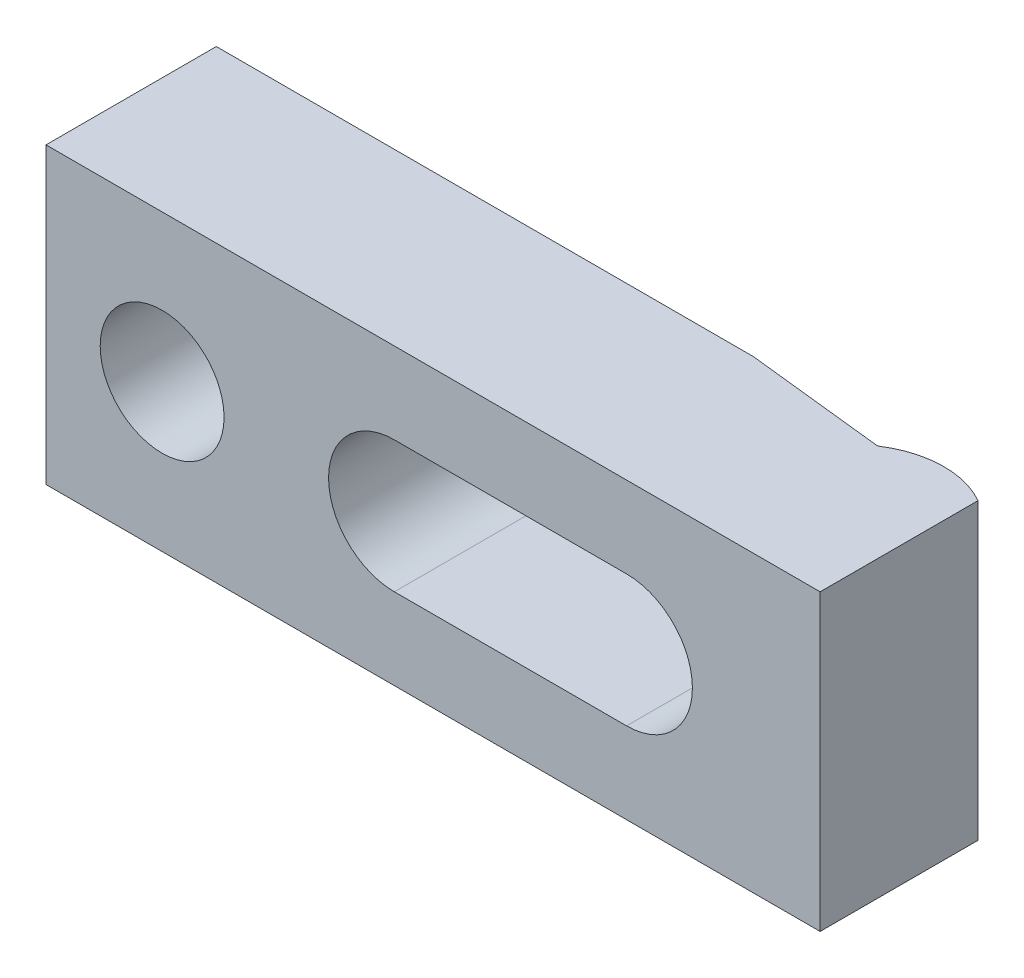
ISO-10303-21;
HEADER;
FILE_DESCRIPTION(('STEP AP214'),'2;1');
FILE_NAME('part.step','',(''),(''),'','','');
FILE_SCHEMA(('AUTOMOTIVE_DESIGN { 1 0 10303 214 1 1 1 1 }'));
ENDSEC;
DATA;
#1=APPLICATION_CONTEXT('core data for automotive mechanical design processes');
#2=APPLICATION_PROTOCOL_DEFINITION('international standard','automotive_design',2000,#1);
#3=PRODUCT_CONTEXT('',#1,'mechanical');
#4=PRODUCT('Part','Part','',(#3));
#5=PRODUCT_RELATED_PRODUCT_CATEGORY('part','',(#4));
#6=PRODUCT_DEFINITION_FORMATION('','',#4);
#7=PRODUCT_DEFINITION_CONTEXT('part definition',#1,'design');
#8=PRODUCT_DEFINITION('design','',#6,#7);
#9=PRODUCT_DEFINITION_SHAPE('','',#8);
#10=(LENGTH_UNIT() NAMED_UNIT(*) SI_UNIT(.MILLI.,.METRE.));
#11=(NAMED_UNIT(*) PLANE_ANGLE_UNIT() SI_UNIT($,.RADIAN.));
#12=(NAMED_UNIT(*) SI_UNIT($,.STERADIAN.) SOLID_ANGLE_UNIT());
#13=UNCERTAINTY_MEASURE_WITH_UNIT(LENGTH_MEASURE(1.E-05),#10,'distance_accuracy_value','');
#14=(GEOMETRIC_REPRESENTATION_CONTEXT(3) GLOBAL_UNCERTAINTY_ASSIGNED_CONTEXT((#13)) GLOBAL_UNIT_ASSIGNED_CONTEXT((#10,
#11,#12)) REPRESENTATION_CONTEXT('',''));
#15=CARTESIAN_POINT('',(0.,0.,0.));
#16=DIRECTION('',(0.,0.,1.));
#17=DIRECTION('',(1.,0.,0.));
#18=AXIS2_PLACEMENT_3D('',#15,#16,#17);
#19=CARTESIAN_POINT('',(-75.,19.,0.));
#20=DIRECTION('',(0.,0.,-1.));
#21=DIRECTION('',(-1.,0.,0.));
#22=AXIS2_PLACEMENT_3D('',#19,#20,#21);
#23=PLANE('',#22);
#24=DIRECTION('',(1.,0.,0.));
#25=VECTOR('',#24,1.);
#26=CARTESIAN_POINT('',(-30.,8.5,0.));
#27=LINE('',#26,#25);
#28=CARTESIAN_POINT('',(-75.,8.5,0.));
#29=VERTEX_POINT('',#28);
#30=CARTESIAN_POINT('',(-5.6,8.5,0.));
#31=VERTEX_POINT('',#30);
#32=EDGE_CURVE('E122',#29,#31,#27,.T.);
#33=ORIENTED_EDGE('',*,*,#32,.F.);
#34=DIRECTION('',(0.,-1.,0.));
#35=VECTOR('',#34,1.);
#36=CARTESIAN_POINT('',(-75.,19.,0.));
#37=LINE('',#36,#35);
#38=CARTESIAN_POINT('',(-75.,19.,0.));
#39=VERTEX_POINT('',#38);
#40=EDGE_CURVE('E139',#39,#29,#37,.T.);
#41=ORIENTED_EDGE('',*,*,#40,.F.);
#42=DIRECTION('',(1.,0.,0.));
#43=VECTOR('',#42,1.);
#44=CARTESIAN_POINT('',(-75.,19.,0.));
#45=LINE('',#44,#43);
#46=CARTESIAN_POINT('',(-5.6,19.,0.));
#47=VERTEX_POINT('',#46);
#48=EDGE_CURVE('E196',#39,#47,#45,.T.);
#49=ORIENTED_EDGE('',*,*,#48,.T.);
#50=DIRECTION('',(0.,-1.,0.));
#51=VECTOR('',#50,1.);
#52=CARTESIAN_POINT('',(-5.6,19.,0.));
#53=LINE('',#52,#51);
#54=EDGE_CURVE('E147',#47,#31,#53,.T.);
#55=ORIENTED_EDGE('',*,*,#54,.T.);
#56=EDGE_LOOP('',(#33,#41,#49,#55));
#57=FACE_BOUND('',#56,.T.);
#58=ADVANCED_FACE('F14',(#57),#23,.T.);
#59=CARTESIAN_POINT('',(-75.,19.,22.));
#60=DIRECTION('',(-1.,0.,0.));
#61=DIRECTION('',(0.,0.,1.));
#62=AXIS2_PLACEMENT_3D('',#59,#60,#61);
#63=PLANE('',#62);
#64=ORIENTED_EDGE('',*,*,#40,.T.);
#65=DIRECTION('',(0.,0.,1.));
#66=VECTOR('',#65,1.);
#67=CARTESIAN_POINT('',(-75.,8.5,22.));
#68=LINE('',#67,#66);
#69=CARTESIAN_POINT('',(-75.,8.5,5.));
#70=VERTEX_POINT('',#69);
#71=EDGE_CURVE('E133',#29,#70,#68,.T.);
#72=ORIENTED_EDGE('',*,*,#71,.T.);
#73=DIRECTION('',(0.,-1.,0.));
#74=VECTOR('',#73,1.);
#75=CARTESIAN_POINT('',(-75.,19.,5.));
#76=LINE('',#75,#74);
#77=CARTESIAN_POINT('',(-75.,-8.5,5.));
#78=VERTEX_POINT('',#77);
#79=EDGE_CURVE('E132',#70,#78,#76,.T.);
#80=ORIENTED_EDGE('',*,*,#79,.T.);
#81=DIRECTION('',(0.,0.,1.));
#82=VECTOR('',#81,1.);
#83=CARTESIAN_POINT('',(-75.,-8.5,22.));
#84=LINE('',#83,#82);
#85=CARTESIAN_POINT('',(-75.,-8.5,0.));
#86=VERTEX_POINT('',#85);
#87=EDGE_CURVE('E113',#86,#78,#84,.T.);
#88=ORIENTED_EDGE('',*,*,#87,.F.);
#89=CARTESIAN_POINT('',(-75.,-19.,0.));
#90=VERTEX_POINT('',#89);
#91=EDGE_CURVE('E129',#86,#90,#37,.T.);
#92=ORIENTED_EDGE('',*,*,#91,.T.);
#93=DIRECTION('',(0.,0.,-1.));
#94=VECTOR('',#93,1.);
#95=CARTESIAN_POINT('',(-75.,-19.,22.));
#96=LINE('',#95,#94);
#97=CARTESIAN_POINT('',(-75.,-19.,22.));
#98=VERTEX_POINT('',#97);
#99=EDGE_CURVE('E169',#98,#90,#96,.T.);
#100=ORIENTED_EDGE('',*,*,#99,.F.);
#101=DIRECTION('',(0.,-1.,0.));
#102=VECTOR('',#101,1.);
#103=CARTESIAN_POINT('',(-75.,19.,22.));
#104=LINE('',#103,#102);
#105=CARTESIAN_POINT('',(-75.,19.,22.));
#106=VERTEX_POINT('',#105);
#107=EDGE_CURVE('E140',#106,#98,#104,.T.);
#108=ORIENTED_EDGE('',*,*,#107,.F.);
#109=DIRECTION('',(0.,0.,-1.));
#110=VECTOR('',#109,1.);
#111=CARTESIAN_POINT('',(-75.,19.,22.));
#112=LINE('',#111,#110);
#113=EDGE_CURVE('E179',#106,#39,#112,.T.);
#114=ORIENTED_EDGE('',*,*,#113,.T.);
#115=EDGE_LOOP('',(#64,#72,#80,#88,#92,#100,#108,#114));
#116=FACE_BOUND('',#115,.T.);
#117=ADVANCED_FACE('F127',(#116),#63,.T.);
#118=CARTESIAN_POINT('',(-30.,0.,22.));
#119=DIRECTION('',(0.,0.,-1.));
#120=DIRECTION('',(-1.,0.,0.));
#121=AXIS2_PLACEMENT_3D('',#118,#119,#120);
#122=CYLINDRICAL_SURFACE('',#121,8.5);
#123=DIRECTION('',(0.,0.,-1.));
#124=VECTOR('',#123,1.);
#125=CARTESIAN_POINT('',(-30.,-8.5,22.));
#126=LINE('',#125,#124);
#127=CARTESIAN_POINT('',(-30.,-8.5,22.));
#128=VERTEX_POINT('',#127);
#129=CARTESIAN_POINT('',(-30.,-8.5,5.));
#130=VERTEX_POINT('',#129);
#131=EDGE_CURVE('E229',#128,#130,#126,.T.);
#132=ORIENTED_EDGE('',*,*,#131,.T.);
#133=CARTESIAN_POINT('',(-30.,0.,5.));
#134=DIRECTION('',(0.,0.,-1.));
#135=DIRECTION('',(-1.,0.,0.));
#136=AXIS2_PLACEMENT_3D('',#133,#134,#135);
#137=CIRCLE('',#136,8.5);
#138=CARTESIAN_POINT('',(-30.,8.5,5.));
#139=VERTEX_POINT('',#138);
#140=EDGE_CURVE('E245',#130,#139,#137,.T.);
#141=ORIENTED_EDGE('',*,*,#140,.T.);
#142=DIRECTION('',(0.,0.,-1.));
#143=VECTOR('',#142,1.);
#144=CARTESIAN_POINT('',(-30.,8.5,22.));
#145=LINE('',#144,#143);
#146=CARTESIAN_POINT('',(-30.,8.5,22.));
#147=VERTEX_POINT('',#146);
#148=EDGE_CURVE('E231',#147,#139,#145,.T.);
#149=ORIENTED_EDGE('',*,*,#148,.F.);
#150=CARTESIAN_POINT('',(-30.,0.,22.));
#151=DIRECTION('',(0.,0.,1.));
#152=DIRECTION('',(1.,0.,0.));
#153=AXIS2_PLACEMENT_3D('',#150,#151,#152);
#154=CIRCLE('',#153,8.5);
#155=EDGE_CURVE('E38',#147,#128,#154,.T.);
#156=ORIENTED_EDGE('',*,*,#155,.T.);
#157=EDGE_LOOP('',(#132,#141,#149,#156));
#158=FACE_BOUND('',#157,.T.);
#159=ADVANCED_FACE('F244',(#158),#122,.F.);
#160=CARTESIAN_POINT('',(-60.,0.,22.));
#161=DIRECTION('',(0.,0.,-1.));
#162=DIRECTION('',(-1.,0.,0.));
#163=AXIS2_PLACEMENT_3D('',#160,#161,#162);
#164=CYLINDRICAL_SURFACE('',#163,8.);
#165=CARTESIAN_POINT('',(-60.,0.,22.));
#166=DIRECTION('',(0.,0.,1.));
#167=DIRECTION('',(1.,0.,0.));
#168=AXIS2_PLACEMENT_3D('',#165,#166,#167);
#169=CIRCLE('',#168,8.);
#170=CARTESIAN_POINT('',(-52.,0.,22.));
#171=VERTEX_POINT('',#170);
#172=EDGE_CURVE('E209',#171,#171,#169,.T.);
#173=ORIENTED_EDGE('',*,*,#172,.T.);
#174=EDGE_LOOP('',(#173));
#175=FACE_BOUND('',#174,.T.);
#176=CARTESIAN_POINT('',(-60.,0.,5.));
#177=DIRECTION('',(0.,0.,-1.));
#178=DIRECTION('',(-1.,0.,0.));
#179=AXIS2_PLACEMENT_3D('',#176,#177,#178);
#180=CIRCLE('',#179,8.);
#181=CARTESIAN_POINT('',(-68.,0.,5.));
#182=VERTEX_POINT('',#181);
#183=EDGE_CURVE('E18',#182,#182,#180,.T.);
#184=ORIENTED_EDGE('',*,*,#183,.T.);
#185=EDGE_LOOP('',(#184));
#186=FACE_BOUND('',#185,.T.);
#187=ADVANCED_FACE('F275',(#175,#186),#164,.F.);
#188=CARTESIAN_POINT('',(25.,19.,22.));
#189=DIRECTION('',(0.,0.,1.));
#190=DIRECTION('',(1.,0.,0.));
#191=AXIS2_PLACEMENT_3D('',#188,#189,#190);
#192=PLANE('',#191);
#193=DIRECTION('',(1.,0.,0.));
#194=VECTOR('',#193,1.);
#195=CARTESIAN_POINT('',(-30.,8.5,22.));
#196=LINE('',#195,#194);
#197=CARTESIAN_POINT('',(0.,8.5,22.));
#198=VERTEX_POINT('',#197);
#199=EDGE_CURVE('E223',#147,#198,#196,.T.);
#200=ORIENTED_EDGE('',*,*,#199,.T.);
#201=CARTESIAN_POINT('',(0.,0.,22.));
#202=DIRECTION('',(0.,0.,1.));
#203=DIRECTION('',(1.,0.,0.));
#204=AXIS2_PLACEMENT_3D('',#201,#202,#203);
#205=CIRCLE('',#204,8.5);
#206=CARTESIAN_POINT('',(0.,-8.5,22.));
#207=VERTEX_POINT('',#206);
#208=EDGE_CURVE('E121',#207,#198,#205,.T.);
#209=ORIENTED_EDGE('',*,*,#208,.F.);
#210=DIRECTION('',(-1.,0.,0.));
#211=VECTOR('',#210,1.);
#212=CARTESIAN_POINT('',(0.,-8.5,22.));
#213=LINE('',#212,#211);
#214=EDGE_CURVE('E218',#207,#128,#213,.T.);
#215=ORIENTED_EDGE('',*,*,#214,.T.);
#216=ORIENTED_EDGE('',*,*,#155,.F.);
#217=EDGE_LOOP('',(#200,#209,#215,#216));
#218=FACE_BOUND('',#217,.T.);
#219=DIRECTION('',(0.,-1.,0.));
#220=VECTOR('',#219,1.);
#221=CARTESIAN_POINT('',(25.,19.,22.));
#222=LINE('',#221,#220);
#223=CARTESIAN_POINT('',(25.,19.,22.));
#224=VERTEX_POINT('',#223);
#225=CARTESIAN_POINT('',(25.,-19.,22.));
#226=VERTEX_POINT('',#225);
#227=EDGE_CURVE('E23',#224,#226,#222,.T.);
#228=ORIENTED_EDGE('',*,*,#227,.F.);
#229=DIRECTION('',(-1.,0.,0.));
#230=VECTOR('',#229,1.);
#231=CARTESIAN_POINT('',(25.,19.,22.));
#232=LINE('',#231,#230);
#233=EDGE_CURVE('E177',#224,#106,#232,.T.);
#234=ORIENTED_EDGE('',*,*,#233,.T.);
#235=ORIENTED_EDGE('',*,*,#107,.T.);
#236=DIRECTION('',(-1.,0.,0.));
#237=VECTOR('',#236,1.);
#238=CARTESIAN_POINT('',(25.,-19.,22.));
#239=LINE('',#238,#237);
#240=EDGE_CURVE('E165',#226,#98,#239,.T.);
#241=ORIENTED_EDGE('',*,*,#240,.F.);
#242=EDGE_LOOP('',(#228,#234,#235,#241));
#243=FACE_BOUND('',#242,.T.);
#244=ORIENTED_EDGE('',*,*,#172,.F.);
#245=EDGE_LOOP('',(#244));
#246=FACE_BOUND('',#245,.T.);
#247=ADVANCED_FACE('F166',(#218,#243,#246),#192,.T.);
#248=ORIENTED_EDGE('',*,*,#91,.F.);
#249=DIRECTION('',(-1.,0.,0.));
#250=VECTOR('',#249,1.);
#251=CARTESIAN_POINT('',(0.,-8.5,0.));
#252=LINE('',#251,#250);
#253=CARTESIAN_POINT('',(-5.6,-8.5,0.));
#254=VERTEX_POINT('',#253);
#255=EDGE_CURVE('E109',#254,#86,#252,.T.);
#256=ORIENTED_EDGE('',*,*,#255,.F.);
#257=CARTESIAN_POINT('',(-5.6,-19.,0.));
#258=VERTEX_POINT('',#257);
#259=EDGE_CURVE('E142',#254,#258,#53,.T.);
#260=ORIENTED_EDGE('',*,*,#259,.T.);
#261=DIRECTION('',(1.,0.,0.));
#262=VECTOR('',#261,1.);
#263=CARTESIAN_POINT('',(-75.,-19.,0.));
#264=LINE('',#263,#262);
#265=EDGE_CURVE('E138',#90,#258,#264,.T.);
#266=ORIENTED_EDGE('',*,*,#265,.F.);
#267=EDGE_LOOP('',(#248,#256,#260,#266));
#268=FACE_BOUND('',#267,.T.);
#269=ADVANCED_FACE('F136',(#268),#23,.T.);
#270=CARTESIAN_POINT('',(25.,19.,22.));
#271=DIRECTION('',(-1.,0.,0.));
#272=DIRECTION('',(0.,0.,1.));
#273=AXIS2_PLACEMENT_3D('',#270,#271,#272);
#274=PLANE('',#273);
#275=DIRECTION('',(0.,-1.,0.));
#276=VECTOR('',#275,1.);
#277=CARTESIAN_POINT('',(25.,19.,1.60769515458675));
#278=LINE('',#277,#276);
#279=CARTESIAN_POINT('',(25.,19.,1.60769515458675));
#280=VERTEX_POINT('',#279);
#281=CARTESIAN_POINT('',(25.,-19.,1.60769515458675));
#282=VERTEX_POINT('',#281);
#283=EDGE_CURVE('E152',#280,#282,#278,.T.);
#284=ORIENTED_EDGE('',*,*,#283,.F.);
#285=DIRECTION('',(0.,0.,-1.));
#286=VECTOR('',#285,1.);
#287=CARTESIAN_POINT('',(25.,19.,22.));
#288=LINE('',#287,#286);
#289=EDGE_CURVE('E143',#224,#280,#288,.T.);
#290=ORIENTED_EDGE('',*,*,#289,.F.);
#291=ORIENTED_EDGE('',*,*,#227,.T.);
#292=DIRECTION('',(0.,0.,-1.));
#293=VECTOR('',#292,1.);
#294=CARTESIAN_POINT('',(25.,-19.,22.));
#295=LINE('',#294,#293);
#296=EDGE_CURVE('E159',#226,#282,#295,.T.);
#297=ORIENTED_EDGE('',*,*,#296,.T.);
#298=EDGE_LOOP('',(#284,#290,#291,#297));
#299=FACE_BOUND('',#298,.T.);
#300=ADVANCED_FACE('F16',(#299),#274,.F.);
#301=CARTESIAN_POINT('',(19.,19.,12.));
#302=DIRECTION('',(0.,-1.,0.));
#303=DIRECTION('',(0.,0.,-1.));
#304=AXIS2_PLACEMENT_3D('',#301,#302,#303);
#305=CYLINDRICAL_SURFACE('',#304,12.);
#306=DIRECTION('',(0.,-1.,0.));
#307=VECTOR('',#306,1.);
#308=CARTESIAN_POINT('',(12.4,19.,1.97802414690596));
#309=LINE('',#308,#307);
#310=CARTESIAN_POINT('',(12.4,19.,1.97802414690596));
#311=VERTEX_POINT('',#310);
#312=CARTESIAN_POINT('',(12.4,-19.,1.97802414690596));
#313=VERTEX_POINT('',#312);
#314=EDGE_CURVE('E150',#311,#313,#309,.T.);
#315=ORIENTED_EDGE('',*,*,#314,.F.);
#316=CARTESIAN_POINT('',(19.,19.,12.));
#317=DIRECTION('',(0.,1.,0.));
#318=DIRECTION('',(0.,0.,1.));
#319=AXIS2_PLACEMENT_3D('',#316,#317,#318);
#320=CIRCLE('',#319,12.);
#321=EDGE_CURVE('E190',#280,#311,#320,.T.);
#322=ORIENTED_EDGE('',*,*,#321,.F.);
#323=ORIENTED_EDGE('',*,*,#283,.T.);
#324=CARTESIAN_POINT('',(19.,-19.,12.));
#325=DIRECTION('',(0.,1.,0.));
#326=DIRECTION('',(0.,0.,1.));
#327=AXIS2_PLACEMENT_3D('',#324,#325,#326);
#328=CIRCLE('',#327,12.);
#329=EDGE_CURVE('E176',#282,#313,#328,.T.);
#330=ORIENTED_EDGE('',*,*,#329,.T.);
#331=EDGE_LOOP('',(#315,#322,#323,#330));
#332=FACE_BOUND('',#331,.T.);
#333=ADVANCED_FACE('F274',(#332),#305,.T.);
#334=CARTESIAN_POINT('',(12.4,19.,1.97802414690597));
#335=DIRECTION('',(-0.109232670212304,0.,0.99401620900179));
#336=DIRECTION('',(0.99401620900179,0.,0.109232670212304));
#337=AXIS2_PLACEMENT_3D('',#334,#335,#336);
#338=PLANE('',#337);
#339=CARTESIAN_POINT('',(0.,0.,0.615385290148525));
#340=DIRECTION('',(-0.109232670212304,0.,0.99401620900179));
#341=DIRECTION('',(-0.99401620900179,0.,-0.109232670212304));
#342=AXIS2_PLACEMENT_3D('',#339,#340,#341);
#343=ELLIPSE('',#342,8.55116840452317,8.5);
#344=CARTESIAN_POINT('',(0.,8.5,0.615385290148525));
#345=VERTEX_POINT('',#344);
#346=CARTESIAN_POINT('',(0.,-8.5,0.615385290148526));
#347=VERTEX_POINT('',#346);
#348=EDGE_CURVE('E9',#345,#347,#343,.F.);
#349=ORIENTED_EDGE('',*,*,#348,.F.);
#350=DIRECTION('',(-0.99401620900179,0.,-0.109232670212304));
#351=VECTOR('',#350,1.);
#352=CARTESIAN_POINT('',(12.4,8.5,1.97802414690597));
#353=LINE('',#352,#351);
#354=EDGE_CURVE('E170',#345,#31,#353,.T.);
#355=ORIENTED_EDGE('',*,*,#354,.T.);
#356=ORIENTED_EDGE('',*,*,#54,.F.);
#357=DIRECTION('',(-0.99401620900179,0.,-0.109232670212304));
#358=VECTOR('',#357,1.);
#359=CARTESIAN_POINT('',(12.4,19.,1.97802414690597));
#360=LINE('',#359,#358);
#361=EDGE_CURVE('E193',#311,#47,#360,.T.);
#362=ORIENTED_EDGE('',*,*,#361,.F.);
#363=ORIENTED_EDGE('',*,*,#314,.T.);
#364=DIRECTION('',(-0.99401620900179,0.,-0.109232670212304));
#365=VECTOR('',#364,1.);
#366=CARTESIAN_POINT('',(12.4,-19.,1.97802414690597));
#367=LINE('',#366,#365);
#368=EDGE_CURVE('E180',#313,#258,#367,.T.);
#369=ORIENTED_EDGE('',*,*,#368,.T.);
#370=ORIENTED_EDGE('',*,*,#259,.F.);
#371=DIRECTION('',(0.99401620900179,0.,0.109232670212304));
#372=VECTOR('',#371,1.);
#373=CARTESIAN_POINT('',(12.4,-8.5,1.97802414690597));
#374=LINE('',#373,#372);
#375=EDGE_CURVE('E117',#254,#347,#374,.T.);
#376=ORIENTED_EDGE('',*,*,#375,.T.);
#377=EDGE_LOOP('',(#349,#355,#356,#362,#363,#369,#370,#376));
#378=FACE_BOUND('',#377,.T.);
#379=ADVANCED_FACE('F237',(#378),#338,.F.);
#380=CARTESIAN_POINT('',(19.,19.,12.));
#381=DIRECTION('',(0.,1.,0.));
#382=DIRECTION('',(0.,0.,1.));
#383=AXIS2_PLACEMENT_3D('',#380,#381,#382);
#384=PLANE('',#383);
#385=ORIENTED_EDGE('',*,*,#233,.F.);
#386=ORIENTED_EDGE('',*,*,#289,.T.);
#387=ORIENTED_EDGE('',*,*,#321,.T.);
#388=ORIENTED_EDGE('',*,*,#361,.T.);
#389=ORIENTED_EDGE('',*,*,#48,.F.);
#390=ORIENTED_EDGE('',*,*,#113,.F.);
#391=EDGE_LOOP('',(#385,#386,#387,#388,#389,#390));
#392=FACE_BOUND('',#391,.T.);
#393=ADVANCED_FACE('F203',(#392),#384,.T.);
#394=CARTESIAN_POINT('',(19.,-19.,12.));
#395=DIRECTION('',(0.,1.,0.));
#396=DIRECTION('',(0.,0.,1.));
#397=AXIS2_PLACEMENT_3D('',#394,#395,#396);
#398=PLANE('',#397);
#399=ORIENTED_EDGE('',*,*,#240,.T.);
#400=ORIENTED_EDGE('',*,*,#99,.T.);
#401=ORIENTED_EDGE('',*,*,#265,.T.);
#402=ORIENTED_EDGE('',*,*,#368,.F.);
#403=ORIENTED_EDGE('',*,*,#329,.F.);
#404=ORIENTED_EDGE('',*,*,#296,.F.);
#405=EDGE_LOOP('',(#399,#400,#401,#402,#403,#404));
#406=FACE_BOUND('',#405,.T.);
#407=ADVANCED_FACE('F173',(#406),#398,.F.);
#408=CARTESIAN_POINT('',(0.,0.,22.));
#409=DIRECTION('',(0.,0.,-1.));
#410=DIRECTION('',(-1.,0.,0.));
#411=AXIS2_PLACEMENT_3D('',#408,#409,#410);
#412=CYLINDRICAL_SURFACE('',#411,8.5);
#413=ORIENTED_EDGE('',*,*,#348,.T.);
#414=DIRECTION('',(0.,0.,-1.));
#415=VECTOR('',#414,1.);
#416=CARTESIAN_POINT('',(0.,-8.5,22.));
#417=LINE('',#416,#415);
#418=EDGE_CURVE('E221',#207,#347,#417,.T.);
#419=ORIENTED_EDGE('',*,*,#418,.F.);
#420=ORIENTED_EDGE('',*,*,#208,.T.);
#421=DIRECTION('',(0.,0.,-1.));
#422=VECTOR('',#421,1.);
#423=CARTESIAN_POINT('',(0.,8.5,22.));
#424=LINE('',#423,#422);
#425=EDGE_CURVE('E233',#198,#345,#424,.T.);
#426=ORIENTED_EDGE('',*,*,#425,.T.);
#427=EDGE_LOOP('',(#413,#419,#420,#426));
#428=FACE_BOUND('',#427,.T.);
#429=ADVANCED_FACE('F240',(#428),#412,.F.);
#430=CARTESIAN_POINT('',(-30.,8.5,22.));
#431=DIRECTION('',(0.,1.,0.));
#432=DIRECTION('',(-1.,0.,0.));
#433=AXIS2_PLACEMENT_3D('',#430,#431,#432);
#434=PLANE('',#433);
#435=ORIENTED_EDGE('',*,*,#32,.T.);
#436=ORIENTED_EDGE('',*,*,#354,.F.);
#437=ORIENTED_EDGE('',*,*,#425,.F.);
#438=ORIENTED_EDGE('',*,*,#199,.F.);
#439=ORIENTED_EDGE('',*,*,#148,.T.);
#440=DIRECTION('',(-1.,0.,0.));
#441=VECTOR('',#440,1.);
#442=CARTESIAN_POINT('',(-15.,8.5,5.));
#443=LINE('',#442,#441);
#444=EDGE_CURVE('E30',#139,#70,#443,.T.);
#445=ORIENTED_EDGE('',*,*,#444,.T.);
#446=ORIENTED_EDGE('',*,*,#71,.F.);
#447=EDGE_LOOP('',(#435,#436,#437,#438,#439,#445,#446));
#448=FACE_BOUND('',#447,.T.);
#449=ADVANCED_FACE('F211',(#448),#434,.F.);
#450=CARTESIAN_POINT('',(0.,-8.5,22.));
#451=DIRECTION('',(0.,-1.,0.));
#452=DIRECTION('',(1.,0.,0.));
#453=AXIS2_PLACEMENT_3D('',#450,#451,#452);
#454=PLANE('',#453);
#455=ORIENTED_EDGE('',*,*,#255,.T.);
#456=ORIENTED_EDGE('',*,*,#87,.T.);
#457=DIRECTION('',(-1.,0.,0.));
#458=VECTOR('',#457,1.);
#459=CARTESIAN_POINT('',(-15.,-8.5,5.));
#460=LINE('',#459,#458);
#461=EDGE_CURVE('E249',#130,#78,#460,.T.);
#462=ORIENTED_EDGE('',*,*,#461,.F.);
#463=ORIENTED_EDGE('',*,*,#131,.F.);
#464=ORIENTED_EDGE('',*,*,#214,.F.);
#465=ORIENTED_EDGE('',*,*,#418,.T.);
#466=ORIENTED_EDGE('',*,*,#375,.F.);
#467=EDGE_LOOP('',(#455,#456,#462,#463,#464,#465,#466));
#468=FACE_BOUND('',#467,.T.);
#469=ADVANCED_FACE('F111',(#468),#454,.F.);
#470=CARTESIAN_POINT('',(-15.,8.5,5.));
#471=DIRECTION('',(0.,0.,-1.));
#472=DIRECTION('',(-1.,0.,0.));
#473=AXIS2_PLACEMENT_3D('',#470,#471,#472);
#474=PLANE('',#473);
#475=ORIENTED_EDGE('',*,*,#183,.F.);
#476=EDGE_LOOP('',(#475));
#477=FACE_BOUND('',#476,.T.);
#478=ORIENTED_EDGE('',*,*,#444,.F.);
#479=ORIENTED_EDGE('',*,*,#140,.F.);
#480=ORIENTED_EDGE('',*,*,#461,.T.);
#481=ORIENTED_EDGE('',*,*,#79,.F.);
#482=EDGE_LOOP('',(#478,#479,#480,#481));
#483=FACE_BOUND('',#482,.T.);
#484=ADVANCED_FACE('F251',(#477,#483),#474,.T.);
#485=CLOSED_SHELL('',(#58,#117,#159,#187,#247,#269,#300,#333,#379,#393,#407,#429,#449,#469,#484));
#486=MANIFOLD_SOLID_BREP('B1',#485);
#487=ADVANCED_BREP_SHAPE_REPRESENTATION('',(#18,#486),#14);
#488=SHAPE_DEFINITION_REPRESENTATION(#9,#487);
ENDSEC;
END-ISO-10303-21;
